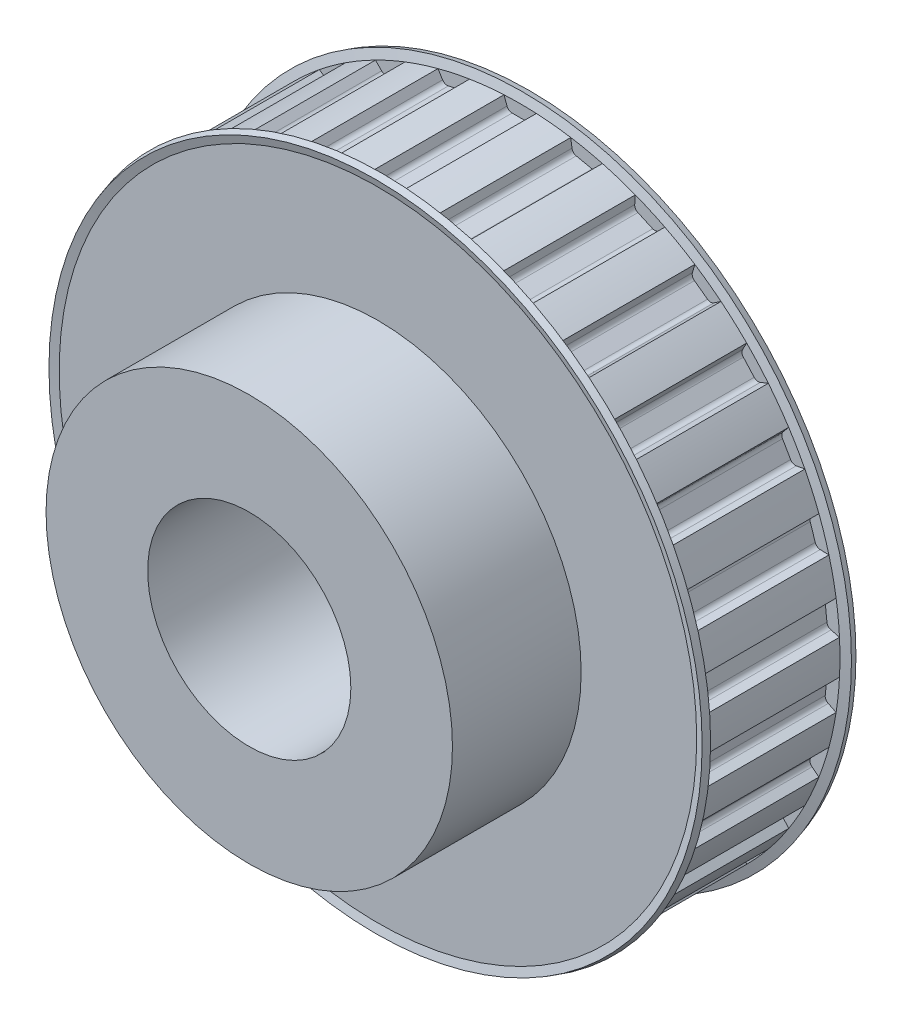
from build123d import *

# Parameters (mm, degrees)
SKETCH1_R        = 59.9567
BASEPULLEY_DEPTH = 25.4
GROOVE_DEPTH     = 12.7
GROOVES_COUNT    = 30
GROOVES_ANGLE    = 348
SKETCH4_W        = 25.4
SKETCH4_H        = 38.1
BORSKE_R         = 19.05
BORE_DEPTH       = 102.731464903


with BuildPart() as part:
    # Sketch1 → BasePulley (new body)
    with BuildSketch(Plane.XY):
        Circle(SKETCH1_R)
    extrude(amount=-BASEPULLEY_DEPTH)

    # Sketch2 → Flange (revolve)
    with BuildSketch(Plane(origin=(0, 0, 0), x_dir=(0, 0, -1), z_dir=(1, 0, 0)), mode=Mode.PRIVATE) as flange_sk:
        Polygon((25.4, 59.9567), (25.904761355, 61.6077), (27.119268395, 61.236387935), (26.67, 59.766897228), (26.67, 0), (-1.27, 0), (-1.27, 59.766897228), (-1.719268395, 61.236387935), (-0.504761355, 61.6077), (0, 59.9567), align=None)
    revolve(flange_sk.sketch.rotate(Axis((0, 0, 0), (0, 0, -1)), 90), axis=Axis((0, 0, 0), (0, 0, -1)))

    # Sketch3 → Groove (cut, symmetric)
    with BuildSketch(Plane.XY.offset(-12.7)):
        with BuildLine():
            Line((-3.0607, 59.9567), (-3.0607, 85.3567))
            Line((-3.0607, 85.3567), (3.0607, 85.3567))
            Line((3.0607, 85.3567), (3.0607, 59.9567))
            Line((3.0607, 59.9567), (2.471980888, 58.339207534))
            ThreePointArc((2.471980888, 58.339207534), (2.100006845, 57.854441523), (1.517253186, 57.6707))
            Line((1.517253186, 57.6707), (-1.517253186, 57.6707))
            ThreePointArc((-1.517253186, 57.6707), (-2.100006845, 57.854441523), (-2.471980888, 58.339207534))
            Line((-2.471980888, 58.339207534), (-3.0607, 59.9567))
        make_face()
    groove = extrude(amount=GROOVE_DEPTH, both=True, mode=Mode.SUBTRACT)

    # Grooves: Groove ×30 about axis
    grooves_axis = Axis((0, 0, -25.4), (0, 0, 1))
    for i in range(1, GROOVES_COUNT):
        add(groove.rotate(grooves_axis, i * GROOVES_ANGLE / (GROOVES_COUNT - 1)), mode=Mode.SUBTRACT)

    # Sketch4 → BaseHub (revolve)
    with BuildSketch(Plane(origin=(0, 0, 0), x_dir=(0, 0, -1), z_dir=(1, 0, 0)), mode=Mode.PRIVATE) as basehub_sk:
        with Locations((-12.7, 19.05)):
            Rectangle(SKETCH4_W, SKETCH4_H)
    revolve(basehub_sk.sketch.rotate(Axis((0, 0, 0), (0, 0, -1)), 273.100594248), axis=Axis((0, 0, 0), (0, 0, -1)))

    # BorSke → Bore (cut, through all)
    with BuildSketch(Plane.XY.offset(25.4)):
        Circle(BORSKE_R)
    extrude(amount=-BORE_DEPTH, mode=Mode.SUBTRACT)


solid = part.part
